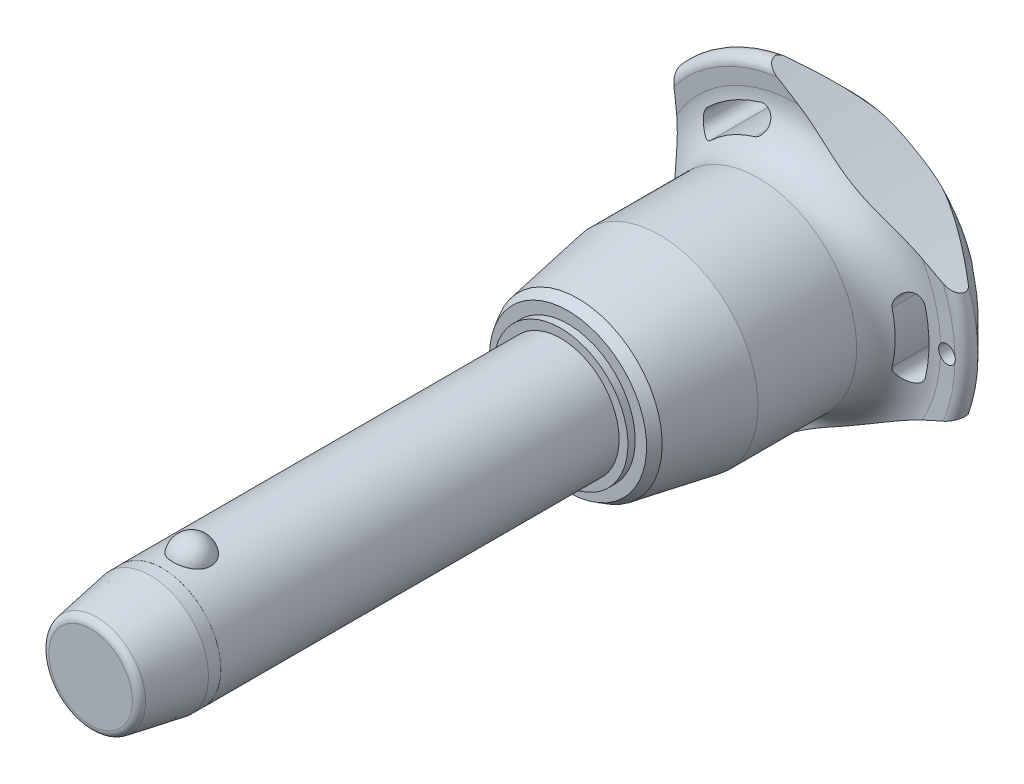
from build123d import *

# Parameters (mm, degrees)
SKETCH1_R           = 10
BOSS_EXTRUDE1_DEPTH = 60
SKETCH2_R           = 8.75
BOSS_EXTRUDE2_DEPTH = 50.7
BOSS_EXTRUDE3_START = 20.5
SKETCH1_2_R         = 10
BOSS_EXTRUDE3_DEPTH = 20.5
CHAMFER1_SIZE       = 10.25
CHAMFER1_SIZE2      = 1.807351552
FILLET1_R           = 1.25
SKETCH6_R           = 176.92625
CUT_EXTRUDE1_DEPTH  = 118.833791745
CIRPATTERN1_COUNT   = 3
SKETCH7_R           = 1.5
CUT_EXTRUDE2_DEPTH  = 118.704532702
SKETCH8_R           = 10
SKETCH8_R_2         = 9.99
CUT_EXTRUDE3_DEPTH  = 12.3


with BuildPart() as part:
    # Sketch1 → Boss-Extrude1 (new body)
    with BuildSketch(Plane.XY):
        Circle(SKETCH1_R)
    extrude(amount=-BOSS_EXTRUDE1_DEPTH)

    # Sketch2 → Boss-Extrude2 (add)
    with BuildSketch(Plane(origin=(0, 0, -60), x_dir=(-1, 0, 0), z_dir=(0, 0, -1))):
        with Locations(Location((0, 0, 0), (0, 0, 180))):
            Circle(SKETCH2_R)
    extrude(amount=BOSS_EXTRUDE2_DEPTH)

    # Sketch3 → Revolve1 (revolve)
    with BuildSketch(Plane(origin=(0, 0, 0), x_dir=(0, 0, -1), z_dir=(1, 0, 0))):
        with BuildLine():
            Line((-3.201562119, 12.5), (-3.201562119, 5.9))
            ThreePointArc((-3.201562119, 5.9), (0.098437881, 9.2), (-3.201562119, 12.5))
        make_face()
        with BuildLine():
            Line((-3.201562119, -5.9), (-3.201562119, -12.5))
            ThreePointArc((-3.201562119, -12.5), (0.098437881, -9.2), (-3.201562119, -5.9))
        make_face()
    revolve(axis=Axis((0, -5.9, 3.201562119), (0, 1, 0)))

    # Sketch1_2 → Boss-Extrude3 (add)
    with BuildSketch(Plane.XY.offset(BOSS_EXTRUDE3_START)):
        Circle(SKETCH1_2_R)
    extrude(amount=-BOSS_EXTRUDE3_DEPTH)

    # Chamfer1
    chamfer1_edges = [part.edges().sort_by_distance(p)[0] for p in [
        (-10, 0, 20.5),
    ]]
    chamfer1_side = [part.faces().sort_by_distance(p)[0] for p in [
        (-10, 0, -19.75),
    ]]
    chamfer(chamfer1_edges, length=CHAMFER1_SIZE, length2=CHAMFER1_SIZE2, reference=chamfer1_side[0])

    # Fillet1
    fillet1_edges = [part.edges().sort_by_distance(p)[0] for p in [
        (-8.192648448, 0, 20.5),
        (-8.75, 0, -110.7),
    ]]
    fillet(fillet1_edges, radius=FILLET1_R)

    # Sketch4 → Revolve2 (revolve)
    with BuildSketch(Plane(origin=(0, 0, 0), x_dir=(0, 0, -1), z_dir=(1, 0, 0)), mode=Mode.PRIVATE) as revolve2_sk:
        Polygon((60, 0), (60, 11.504815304), (61.25, 11.504815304), (61.25, 13.461079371), (62.944174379, 14.439211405), (76.9, 16.9), (93.8, 16.9), (93.8, 0), align=None)
    revolve(revolve2_sk.sketch.rotate(Axis((0, 0, -93.8), (0, 0, 1)), 90), axis=Axis((0, 0, -93.8), (0, 0, 1)))

    # Sketch5 → Revolve3 (revolve)
    with BuildSketch(Plane(origin=(0, 0, 0), x_dir=(0, 0, -1), z_dir=(1, 0, 0)), mode=Mode.PRIVATE) as revolve3_sk:
        with BuildLine():
            Line((100.790129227, 24.271609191), (100.652256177, 26.865060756))
            ThreePointArc((100.652256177, 26.865060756), (101.598671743, 28.411427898), (103.38137085, 28.08137085))
            Line((103.38137085, 28.08137085), (109.763226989, 21.69951471))
            ThreePointArc((109.763226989, 21.69951471), (110.7, 19.381044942), (109.683055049, 17.096604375))
            ThreePointArc((109.683055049, 17.096604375), (104.18864484, 9.321268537), (102.25, 0))
            Line((102.25, 0), (93.8, 0))
            Line((93.8, 0), (93.8, 16.9))
            ThreePointArc((93.8, 16.9), (98.879432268, 19.083427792), (100.790129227, 24.271609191))
        make_face()
    revolve(revolve3_sk.sketch.rotate(Axis((0, 0, -102.25), (0, 0, 1)), 90), axis=Axis((0, 0, -102.25), (0, 0, 1)))

    # Sketch6 → Cut-Extrude1 (cut, through all)
    with BuildSketch(Plane.XY):
        with Locations((-197.42625, 0)):
            Circle(SKETCH6_R)
        with BuildLine():
            ThreePointArc((21.802992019, -5.260839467), (22.428706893, 0), (21.802992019, 5.260839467))
            ThreePointArc((21.802992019, 5.260839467), (19.579234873, 6.620060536), (18.220013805, 4.39630339))
            ThreePointArc((18.220013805, 4.39630339), (18.742902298, 0), (18.220013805, -4.39630339))
            ThreePointArc((18.220013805, -4.39630339), (19.579234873, -6.620060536), (21.802992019, -5.260839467))
        make_face()
    cut_extrude1 = extrude(amount=-CUT_EXTRUDE1_DEPTH, mode=Mode.SUBTRACT)

    # CirPattern1: Cut-Extrude1 ×3 about axis
    cirpattern1_axis = Axis((0, 0, 0), (0, 0, 1))
    for i in range(1, CIRPATTERN1_COUNT):
        add(cut_extrude1.rotate(cirpattern1_axis, i * 360 / CIRPATTERN1_COUNT), mode=Mode.SUBTRACT)

    # Sketch7 → Cut-Extrude2 (cut, through all)
    with BuildSketch(Plane.XY):
        with Locations(Location((25.428706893, 0, 0), (0, 0, 17.230769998))):
            Circle(SKETCH7_R)
    extrude(amount=-CUT_EXTRUDE2_DEPTH, mode=Mode.SUBTRACT)

    # Sketch8 → Cut-Extrude3 (cut)
    with BuildSketch(Plane.XY.offset(20.5)):
        Circle(SKETCH8_R)
        Circle(SKETCH8_R_2, mode=Mode.SUBTRACT)
    extrude(amount=-CUT_EXTRUDE3_DEPTH, mode=Mode.SUBTRACT)


solid = part.part
